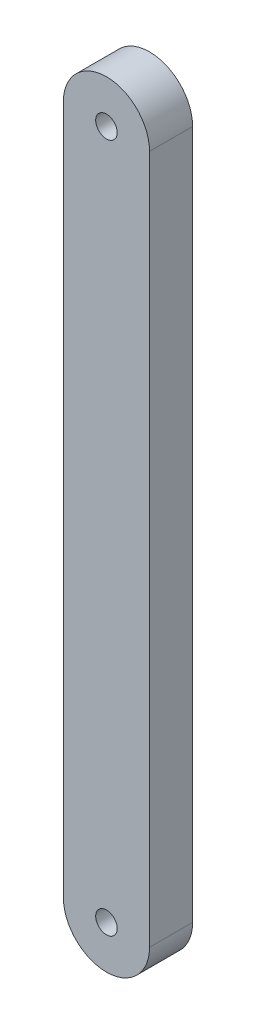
ISO-10303-21;
HEADER;
FILE_DESCRIPTION(('STEP AP214'),'2;1');
FILE_NAME('part.step','',(''),(''),'','','');
FILE_SCHEMA(('AUTOMOTIVE_DESIGN { 1 0 10303 214 1 1 1 1 }'));
ENDSEC;
DATA;
#1=APPLICATION_CONTEXT('core data for automotive mechanical design processes');
#2=APPLICATION_PROTOCOL_DEFINITION('international standard','automotive_design',2000,#1);
#3=PRODUCT_CONTEXT('',#1,'mechanical');
#4=PRODUCT('Part','Part','',(#3));
#5=PRODUCT_RELATED_PRODUCT_CATEGORY('part','',(#4));
#6=PRODUCT_DEFINITION_FORMATION('','',#4);
#7=PRODUCT_DEFINITION_CONTEXT('part definition',#1,'design');
#8=PRODUCT_DEFINITION('design','',#6,#7);
#9=PRODUCT_DEFINITION_SHAPE('','',#8);
#10=(LENGTH_UNIT() NAMED_UNIT(*) SI_UNIT(.MILLI.,.METRE.));
#11=(NAMED_UNIT(*) PLANE_ANGLE_UNIT() SI_UNIT($,.RADIAN.));
#12=(NAMED_UNIT(*) SI_UNIT($,.STERADIAN.) SOLID_ANGLE_UNIT());
#13=UNCERTAINTY_MEASURE_WITH_UNIT(LENGTH_MEASURE(1.E-05),#10,'distance_accuracy_value','');
#14=(GEOMETRIC_REPRESENTATION_CONTEXT(3) GLOBAL_UNCERTAINTY_ASSIGNED_CONTEXT((#13)) GLOBAL_UNIT_ASSIGNED_CONTEXT((#10,
#11,#12)) REPRESENTATION_CONTEXT('',''));
#15=CARTESIAN_POINT('',(0.,0.,0.));
#16=DIRECTION('',(0.,0.,1.));
#17=DIRECTION('',(1.,0.,0.));
#18=AXIS2_PLACEMENT_3D('',#15,#16,#17);
#19=CARTESIAN_POINT('',(0.,-125.,20.));
#20=DIRECTION('',(0.,0.,-1.));
#21=DIRECTION('',(-1.,0.,0.));
#22=AXIS2_PLACEMENT_3D('',#19,#20,#21);
#23=CYLINDRICAL_SURFACE('',#22,20.);
#24=CARTESIAN_POINT('',(0.,-125.,0.));
#25=DIRECTION('',(0.,0.,1.));
#26=DIRECTION('',(1.,0.,0.));
#27=AXIS2_PLACEMENT_3D('',#24,#25,#26);
#28=CIRCLE('',#27,20.);
#29=CARTESIAN_POINT('',(-20.,-125.,0.));
#30=VERTEX_POINT('',#29);
#31=CARTESIAN_POINT('',(20.,-125.,0.));
#32=VERTEX_POINT('',#31);
#33=EDGE_CURVE('E105',#30,#32,#28,.T.);
#34=ORIENTED_EDGE('',*,*,#33,.T.);
#35=DIRECTION('',(0.,0.,-1.));
#36=VECTOR('',#35,1.);
#37=CARTESIAN_POINT('',(20.,-125.,20.));
#38=LINE('',#37,#36);
#39=CARTESIAN_POINT('',(20.,-125.,20.));
#40=VERTEX_POINT('',#39);
#41=EDGE_CURVE('E11',#40,#32,#38,.T.);
#42=ORIENTED_EDGE('',*,*,#41,.F.);
#43=CARTESIAN_POINT('',(0.,-125.,20.));
#44=DIRECTION('',(0.,0.,1.));
#45=DIRECTION('',(1.,0.,0.));
#46=AXIS2_PLACEMENT_3D('',#43,#44,#45);
#47=CIRCLE('',#46,20.);
#48=CARTESIAN_POINT('',(-20.,-125.,20.));
#49=VERTEX_POINT('',#48);
#50=EDGE_CURVE('E102',#49,#40,#47,.T.);
#51=ORIENTED_EDGE('',*,*,#50,.F.);
#52=DIRECTION('',(0.,0.,-1.));
#53=VECTOR('',#52,1.);
#54=CARTESIAN_POINT('',(-20.,-125.,20.));
#55=LINE('',#54,#53);
#56=EDGE_CURVE('E39',#49,#30,#55,.T.);
#57=ORIENTED_EDGE('',*,*,#56,.T.);
#58=EDGE_LOOP('',(#34,#42,#51,#57));
#59=FACE_BOUND('',#58,.T.);
#60=ADVANCED_FACE('F30',(#59),#23,.T.);
#61=CARTESIAN_POINT('',(20.,125.,20.));
#62=DIRECTION('',(-1.,0.,0.));
#63=DIRECTION('',(0.,-1.,0.));
#64=AXIS2_PLACEMENT_3D('',#61,#62,#63);
#65=PLANE('',#64);
#66=DIRECTION('',(0.,1.,0.));
#67=VECTOR('',#66,1.);
#68=CARTESIAN_POINT('',(20.,125.,0.));
#69=LINE('',#68,#67);
#70=CARTESIAN_POINT('',(20.,195.,0.));
#71=VERTEX_POINT('',#70);
#72=EDGE_CURVE('E59',#32,#71,#69,.T.);
#73=ORIENTED_EDGE('',*,*,#72,.T.);
#74=DIRECTION('',(0.,0.,1.));
#75=VECTOR('',#74,1.);
#76=CARTESIAN_POINT('',(20.,195.,0.));
#77=LINE('',#76,#75);
#78=CARTESIAN_POINT('',(20.,195.,20.));
#79=VERTEX_POINT('',#78);
#80=EDGE_CURVE('E87',#71,#79,#77,.T.);
#81=ORIENTED_EDGE('',*,*,#80,.T.);
#82=DIRECTION('',(0.,1.,0.));
#83=VECTOR('',#82,1.);
#84=CARTESIAN_POINT('',(20.,125.,20.));
#85=LINE('',#84,#83);
#86=EDGE_CURVE('E78',#40,#79,#85,.T.);
#87=ORIENTED_EDGE('',*,*,#86,.F.);
#88=ORIENTED_EDGE('',*,*,#41,.T.);
#89=EDGE_LOOP('',(#73,#81,#87,#88));
#90=FACE_BOUND('',#89,.T.);
#91=ADVANCED_FACE('F128',(#90),#65,.F.);
#92=CARTESIAN_POINT('',(-20.,125.,20.));
#93=DIRECTION('',(1.,0.,0.));
#94=DIRECTION('',(0.,1.,0.));
#95=AXIS2_PLACEMENT_3D('',#92,#93,#94);
#96=PLANE('',#95);
#97=DIRECTION('',(0.,-1.,0.));
#98=VECTOR('',#97,1.);
#99=CARTESIAN_POINT('',(-20.,125.,0.));
#100=LINE('',#99,#98);
#101=CARTESIAN_POINT('',(-20.,195.,0.));
#102=VERTEX_POINT('',#101);
#103=EDGE_CURVE('E64',#102,#30,#100,.T.);
#104=ORIENTED_EDGE('',*,*,#103,.T.);
#105=ORIENTED_EDGE('',*,*,#56,.F.);
#106=DIRECTION('',(0.,-1.,0.));
#107=VECTOR('',#106,1.);
#108=CARTESIAN_POINT('',(-20.,125.,20.));
#109=LINE('',#108,#107);
#110=CARTESIAN_POINT('',(-20.,195.,20.));
#111=VERTEX_POINT('',#110);
#112=EDGE_CURVE('E47',#111,#49,#109,.T.);
#113=ORIENTED_EDGE('',*,*,#112,.F.);
#114=DIRECTION('',(0.,0.,1.));
#115=VECTOR('',#114,1.);
#116=CARTESIAN_POINT('',(-20.,195.,0.));
#117=LINE('',#116,#115);
#118=EDGE_CURVE('E74',#102,#111,#117,.T.);
#119=ORIENTED_EDGE('',*,*,#118,.F.);
#120=EDGE_LOOP('',(#104,#105,#113,#119));
#121=FACE_BOUND('',#120,.T.);
#122=ADVANCED_FACE('F73',(#121),#96,.F.);
#123=CARTESIAN_POINT('',(0.,-125.,20.));
#124=DIRECTION('',(0.,0.,1.));
#125=DIRECTION('',(1.,0.,0.));
#126=AXIS2_PLACEMENT_3D('',#123,#124,#125);
#127=PLANE('',#126);
#128=CARTESIAN_POINT('',(0.,195.,20.));
#129=DIRECTION('',(0.,0.,1.));
#130=DIRECTION('',(1.,0.,0.));
#131=AXIS2_PLACEMENT_3D('',#128,#129,#130);
#132=CIRCLE('',#131,5.);
#133=CARTESIAN_POINT('',(4.99999999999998,195.,20.));
#134=VERTEX_POINT('',#133);
#135=EDGE_CURVE('E95',#134,#134,#132,.T.);
#136=ORIENTED_EDGE('',*,*,#135,.F.);
#137=EDGE_LOOP('',(#136));
#138=FACE_BOUND('',#137,.T.);
#139=CARTESIAN_POINT('',(0.,-125.,20.));
#140=DIRECTION('',(0.,0.,1.));
#141=DIRECTION('',(1.,0.,0.));
#142=AXIS2_PLACEMENT_3D('',#139,#140,#141);
#143=CIRCLE('',#142,5.);
#144=CARTESIAN_POINT('',(5.00000000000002,-125.,20.));
#145=VERTEX_POINT('',#144);
#146=EDGE_CURVE('E86',#145,#145,#143,.T.);
#147=ORIENTED_EDGE('',*,*,#146,.F.);
#148=EDGE_LOOP('',(#147));
#149=FACE_BOUND('',#148,.T.);
#150=ORIENTED_EDGE('',*,*,#50,.T.);
#151=ORIENTED_EDGE('',*,*,#86,.T.);
#152=CARTESIAN_POINT('',(0.,195.,20.));
#153=DIRECTION('',(0.,0.,1.));
#154=DIRECTION('',(1.,0.,0.));
#155=AXIS2_PLACEMENT_3D('',#152,#153,#154);
#156=CIRCLE('',#155,20.);
#157=EDGE_CURVE('E84',#79,#111,#156,.T.);
#158=ORIENTED_EDGE('',*,*,#157,.T.);
#159=ORIENTED_EDGE('',*,*,#112,.T.);
#160=EDGE_LOOP('',(#150,#151,#158,#159));
#161=FACE_BOUND('',#160,.T.);
#162=ADVANCED_FACE('F89',(#138,#149,#161),#127,.T.);
#163=CARTESIAN_POINT('',(0.,-125.,0.));
#164=DIRECTION('',(0.,0.,1.));
#165=DIRECTION('',(1.,0.,0.));
#166=AXIS2_PLACEMENT_3D('',#163,#164,#165);
#167=PLANE('',#166);
#168=CARTESIAN_POINT('',(0.,195.,0.));
#169=DIRECTION('',(0.,0.,1.));
#170=DIRECTION('',(1.,0.,0.));
#171=AXIS2_PLACEMENT_3D('',#168,#169,#170);
#172=CIRCLE('',#171,5.);
#173=CARTESIAN_POINT('',(4.99999999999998,195.,0.));
#174=VERTEX_POINT('',#173);
#175=EDGE_CURVE('E91',#174,#174,#172,.T.);
#176=ORIENTED_EDGE('',*,*,#175,.T.);
#177=EDGE_LOOP('',(#176));
#178=FACE_BOUND('',#177,.T.);
#179=CARTESIAN_POINT('',(0.,-125.,0.));
#180=DIRECTION('',(0.,0.,1.));
#181=DIRECTION('',(1.,0.,0.));
#182=AXIS2_PLACEMENT_3D('',#179,#180,#181);
#183=CIRCLE('',#182,5.);
#184=CARTESIAN_POINT('',(5.00000000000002,-125.,0.));
#185=VERTEX_POINT('',#184);
#186=EDGE_CURVE('E33',#185,#185,#183,.T.);
#187=ORIENTED_EDGE('',*,*,#186,.T.);
#188=EDGE_LOOP('',(#187));
#189=FACE_BOUND('',#188,.T.);
#190=ORIENTED_EDGE('',*,*,#33,.F.);
#191=ORIENTED_EDGE('',*,*,#103,.F.);
#192=CARTESIAN_POINT('',(0.,195.,0.));
#193=DIRECTION('',(0.,0.,1.));
#194=DIRECTION('',(1.,0.,0.));
#195=AXIS2_PLACEMENT_3D('',#192,#193,#194);
#196=CIRCLE('',#195,20.);
#197=EDGE_CURVE('E85',#71,#102,#196,.T.);
#198=ORIENTED_EDGE('',*,*,#197,.F.);
#199=ORIENTED_EDGE('',*,*,#72,.F.);
#200=EDGE_LOOP('',(#190,#191,#198,#199));
#201=FACE_BOUND('',#200,.T.);
#202=ADVANCED_FACE('F112',(#178,#189,#201),#167,.F.);
#203=CARTESIAN_POINT('',(0.,-125.,-80.));
#204=DIRECTION('',(0.,0.,1.));
#205=DIRECTION('',(1.,0.,0.));
#206=AXIS2_PLACEMENT_3D('',#203,#204,#205);
#207=CYLINDRICAL_SURFACE('',#206,5.);
#208=CARTESIAN_POINT('',(5.00000000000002,-125.,20.));
#209=CARTESIAN_POINT('',(5.00000000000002,-125.,19.7916666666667));
#210=CARTESIAN_POINT('',(5.00000000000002,-125.,19.5833333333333));
#211=CARTESIAN_POINT('',(5.00000000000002,-125.,19.1666666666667));
#212=CARTESIAN_POINT('',(5.00000000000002,-125.,18.9583333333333));
#213=CARTESIAN_POINT('',(5.00000000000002,-125.,18.5416666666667));
#214=CARTESIAN_POINT('',(5.00000000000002,-125.,18.3333333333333));
#215=CARTESIAN_POINT('',(5.00000000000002,-125.,17.9166666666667));
#216=CARTESIAN_POINT('',(5.00000000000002,-125.,17.7083333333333));
#217=CARTESIAN_POINT('',(5.00000000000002,-125.,17.2916666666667));
#218=CARTESIAN_POINT('',(5.00000000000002,-125.,17.0833333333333));
#219=CARTESIAN_POINT('',(5.00000000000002,-125.,16.6666666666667));
#220=CARTESIAN_POINT('',(5.00000000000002,-125.,16.4583333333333));
#221=CARTESIAN_POINT('',(5.00000000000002,-125.,16.0416666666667));
#222=CARTESIAN_POINT('',(5.00000000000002,-125.,15.8333333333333));
#223=CARTESIAN_POINT('',(5.00000000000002,-125.,15.4166666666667));
#224=CARTESIAN_POINT('',(5.00000000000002,-125.,15.2083333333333));
#225=CARTESIAN_POINT('',(5.00000000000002,-125.,14.7916666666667));
#226=CARTESIAN_POINT('',(5.00000000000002,-125.,14.5833333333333));
#227=CARTESIAN_POINT('',(5.00000000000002,-125.,14.1666666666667));
#228=CARTESIAN_POINT('',(5.00000000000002,-125.,13.9583333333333));
#229=CARTESIAN_POINT('',(5.00000000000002,-125.,13.5416666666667));
#230=CARTESIAN_POINT('',(5.00000000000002,-125.,13.3333333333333));
#231=CARTESIAN_POINT('',(5.00000000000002,-125.,12.9166666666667));
#232=CARTESIAN_POINT('',(5.00000000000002,-125.,12.7083333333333));
#233=CARTESIAN_POINT('',(5.00000000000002,-125.,12.2916666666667));
#234=CARTESIAN_POINT('',(5.00000000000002,-125.,12.0833333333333));
#235=CARTESIAN_POINT('',(5.00000000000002,-125.,11.6666666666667));
#236=CARTESIAN_POINT('',(5.00000000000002,-125.,11.4583333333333));
#237=CARTESIAN_POINT('',(5.00000000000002,-125.,11.0416666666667));
#238=CARTESIAN_POINT('',(5.00000000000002,-125.,10.8333333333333));
#239=CARTESIAN_POINT('',(5.00000000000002,-125.,10.4166666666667));
#240=CARTESIAN_POINT('',(5.00000000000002,-125.,10.2083333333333));
#241=CARTESIAN_POINT('',(5.00000000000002,-125.,9.79166666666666));
#242=CARTESIAN_POINT('',(5.00000000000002,-125.,9.58333333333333));
#243=CARTESIAN_POINT('',(5.00000000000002,-125.,9.16666666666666));
#244=CARTESIAN_POINT('',(5.00000000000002,-125.,8.95833333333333));
#245=CARTESIAN_POINT('',(5.00000000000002,-125.,8.54166666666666));
#246=CARTESIAN_POINT('',(5.00000000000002,-125.,8.33333333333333));
#247=CARTESIAN_POINT('',(5.00000000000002,-125.,7.91666666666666));
#248=CARTESIAN_POINT('',(5.00000000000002,-125.,7.70833333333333));
#249=CARTESIAN_POINT('',(5.00000000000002,-125.,7.29166666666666));
#250=CARTESIAN_POINT('',(5.00000000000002,-125.,7.08333333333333));
#251=CARTESIAN_POINT('',(5.00000000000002,-125.,6.66666666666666));
#252=CARTESIAN_POINT('',(5.00000000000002,-125.,6.45833333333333));
#253=CARTESIAN_POINT('',(5.00000000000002,-125.,6.04166666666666));
#254=CARTESIAN_POINT('',(5.00000000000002,-125.,5.83333333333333));
#255=CARTESIAN_POINT('',(5.00000000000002,-125.,5.41666666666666));
#256=CARTESIAN_POINT('',(5.00000000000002,-125.,5.20833333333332));
#257=CARTESIAN_POINT('',(5.00000000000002,-125.,4.79166666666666));
#258=CARTESIAN_POINT('',(5.00000000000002,-125.,4.58333333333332));
#259=CARTESIAN_POINT('',(5.00000000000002,-125.,4.16666666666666));
#260=CARTESIAN_POINT('',(5.00000000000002,-125.,3.95833333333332));
#261=CARTESIAN_POINT('',(5.00000000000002,-125.,3.54166666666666));
#262=CARTESIAN_POINT('',(5.00000000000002,-125.,3.33333333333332));
#263=CARTESIAN_POINT('',(5.00000000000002,-125.,2.91666666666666));
#264=CARTESIAN_POINT('',(5.00000000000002,-125.,2.70833333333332));
#265=CARTESIAN_POINT('',(5.00000000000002,-125.,2.29166666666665));
#266=CARTESIAN_POINT('',(5.00000000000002,-125.,2.08333333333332));
#267=CARTESIAN_POINT('',(5.00000000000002,-125.,1.66666666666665));
#268=CARTESIAN_POINT('',(5.00000000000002,-125.,1.45833333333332));
#269=CARTESIAN_POINT('',(5.00000000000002,-125.,1.04166666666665));
#270=CARTESIAN_POINT('',(5.00000000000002,-125.,0.83333333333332));
#271=CARTESIAN_POINT('',(5.00000000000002,-125.,0.416666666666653));
#272=CARTESIAN_POINT('',(5.00000000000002,-125.,0.20833333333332));
#273=CARTESIAN_POINT('',(5.00000000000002,-125.,0.));
#274=B_SPLINE_CURVE_WITH_KNOTS('',3,(#208,#209,#210,#211,#212,#213,#214,#215,#216,#217,#218,
#219,#220,#221,#222,#223,#224,#225,#226,#227,#228,#229,#230,#231,#232,#233,#234,#235,#236,#237,
#238,#239,#240,#241,#242,#243,#244,#245,#246,#247,#248,#249,#250,#251,#252,#253,#254,#255,#256,
#257,#258,#259,#260,#261,#262,#263,#264,#265,#266,#267,#268,#269,#270,#271,#272,#273),
.UNSPECIFIED.,.F.,.F.,(4,2,2,2,2,2,2,2,2,2,2,2,2,2,2,2,2,2,2,2,2,2,2,2,2,2,2,2,2,2,2,2,4),(0.,
0.625000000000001,1.25,1.875,2.5,3.125,3.75,4.375,5.,5.62500000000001,6.25000000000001,
6.87500000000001,7.50000000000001,8.12500000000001,8.75000000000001,9.37500000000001,10.,10.625,
11.25,11.875,12.5,13.125,13.75,14.375,15.,15.625,16.25,16.875,17.5,18.125,18.75,19.375,20.),.UNSPECIFIED.);
#275=EDGE_CURVE('BSEAM114',#145,#185,#274,.T.);
#276=ORIENTED_EDGE('',*,*,#146,.T.);
#277=ORIENTED_EDGE('',*,*,#186,.F.);
#278=ORIENTED_EDGE('',*,*,#275,.T.);
#279=ORIENTED_EDGE('',*,*,#275,.F.);
#280=EDGE_LOOP('',(#276,#278,#277,#279));
#281=FACE_BOUND('',#280,.T.);
#282=ADVANCED_FACE('F114',(#281),#207,.F.);
#283=CARTESIAN_POINT('',(0.,195.,0.));
#284=DIRECTION('',(0.,0.,1.));
#285=DIRECTION('',(1.,0.,0.));
#286=AXIS2_PLACEMENT_3D('',#283,#284,#285);
#287=CYLINDRICAL_SURFACE('',#286,20.);
#288=ORIENTED_EDGE('',*,*,#157,.F.);
#289=ORIENTED_EDGE('',*,*,#80,.F.);
#290=ORIENTED_EDGE('',*,*,#197,.T.);
#291=ORIENTED_EDGE('',*,*,#118,.T.);
#292=EDGE_LOOP('',(#288,#289,#290,#291));
#293=FACE_BOUND('',#292,.T.);
#294=ADVANCED_FACE('F82',(#293),#287,.T.);
#295=CARTESIAN_POINT('',(0.,195.,0.));
#296=DIRECTION('',(0.,0.,1.));
#297=DIRECTION('',(1.,0.,0.));
#298=AXIS2_PLACEMENT_3D('',#295,#296,#297);
#299=CYLINDRICAL_SURFACE('',#298,5.);
#300=ORIENTED_EDGE('',*,*,#175,.F.);
#301=EDGE_LOOP('',(#300));
#302=FACE_BOUND('',#301,.T.);
#303=ORIENTED_EDGE('',*,*,#135,.T.);
#304=EDGE_LOOP('',(#303));
#305=FACE_BOUND('',#304,.T.);
#306=ADVANCED_FACE('F157',(#302,#305),#299,.F.);
#307=CLOSED_SHELL('',(#60,#91,#122,#162,#202,#282,#294,#306));
#308=MANIFOLD_SOLID_BREP('B2',#307);
#309=ADVANCED_BREP_SHAPE_REPRESENTATION('',(#18,#308),#14);
#310=SHAPE_DEFINITION_REPRESENTATION(#9,#309);
ENDSEC;
END-ISO-10303-21;
